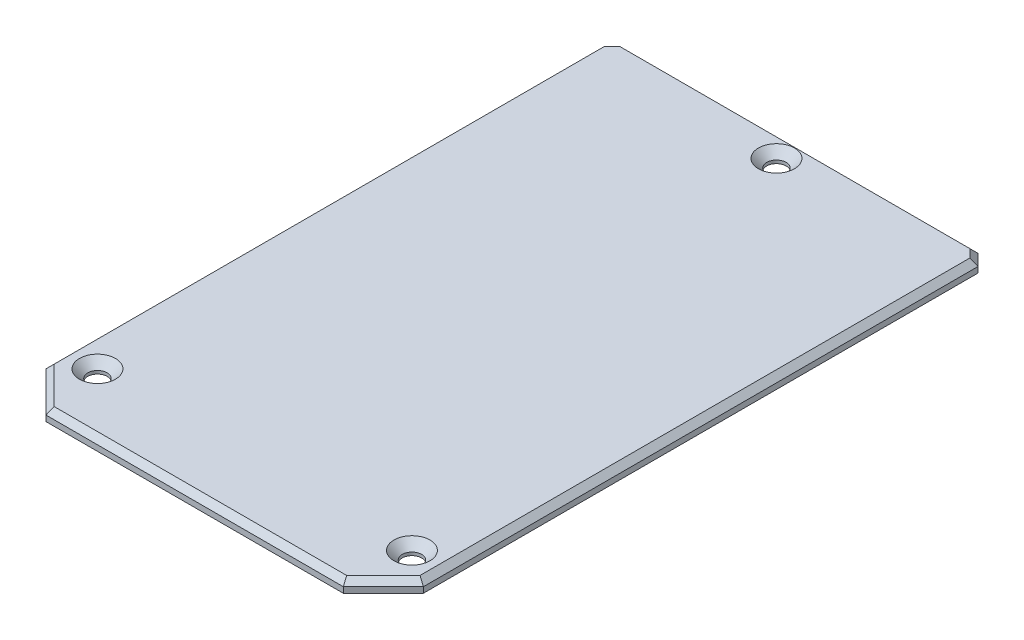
ISO-10303-21;
HEADER;
FILE_DESCRIPTION(('STEP AP214'),'2;1');
FILE_NAME('part.step','',(''),(''),'','','');
FILE_SCHEMA(('AUTOMOTIVE_DESIGN { 1 0 10303 214 1 1 1 1 }'));
ENDSEC;
DATA;
#1=APPLICATION_CONTEXT('core data for automotive mechanical design processes');
#2=APPLICATION_PROTOCOL_DEFINITION('international standard','automotive_design',2000,#1);
#3=PRODUCT_CONTEXT('',#1,'mechanical');
#4=PRODUCT('Part','Part','',(#3));
#5=PRODUCT_RELATED_PRODUCT_CATEGORY('part','',(#4));
#6=PRODUCT_DEFINITION_FORMATION('','',#4);
#7=PRODUCT_DEFINITION_CONTEXT('part definition',#1,'design');
#8=PRODUCT_DEFINITION('design','',#6,#7);
#9=PRODUCT_DEFINITION_SHAPE('','',#8);
#10=(LENGTH_UNIT() NAMED_UNIT(*) SI_UNIT(.MILLI.,.METRE.));
#11=(NAMED_UNIT(*) PLANE_ANGLE_UNIT() SI_UNIT($,.RADIAN.));
#12=(NAMED_UNIT(*) SI_UNIT($,.STERADIAN.) SOLID_ANGLE_UNIT());
#13=UNCERTAINTY_MEASURE_WITH_UNIT(LENGTH_MEASURE(1.E-05),#10,'distance_accuracy_value','');
#14=(GEOMETRIC_REPRESENTATION_CONTEXT(3) GLOBAL_UNCERTAINTY_ASSIGNED_CONTEXT((#13)) GLOBAL_UNIT_ASSIGNED_CONTEXT((#10,
#11,#12)) REPRESENTATION_CONTEXT('',''));
#15=CARTESIAN_POINT('',(0.,0.,0.));
#16=DIRECTION('',(0.,0.,1.));
#17=DIRECTION('',(1.,0.,0.));
#18=AXIS2_PLACEMENT_3D('',#15,#16,#17);
#19=CARTESIAN_POINT('',(32.9999999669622,2.,45.9999999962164));
#20=DIRECTION('',(-1.,0.,0.));
#21=DIRECTION('',(0.,0.,1.));
#22=AXIS2_PLACEMENT_3D('',#19,#20,#21);
#23=PLANE('',#22);
#24=DIRECTION('',(0.,1.,0.));
#25=VECTOR('',#24,1.);
#26=CARTESIAN_POINT('',(32.9999999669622,2.,-50.9999999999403));
#27=LINE('',#26,#25);
#28=CARTESIAN_POINT('',(32.9999999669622,0.,-50.9999999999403));
#29=VERTEX_POINT('',#28);
#30=CARTESIAN_POINT('',(32.9999999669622,0.999999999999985,-50.9999999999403));
#31=VERTEX_POINT('',#30);
#32=EDGE_CURVE('E167',#29,#31,#27,.T.);
#33=ORIENTED_EDGE('',*,*,#32,.T.);
#34=DIRECTION('',(0.,0.,1.));
#35=VECTOR('',#34,1.);
#36=CARTESIAN_POINT('',(32.9999999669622,0.999999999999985,45.9999999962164));
#37=LINE('',#36,#35);
#38=CARTESIAN_POINT('',(32.9999999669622,0.999999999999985,45.9999999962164));
#39=VERTEX_POINT('',#38);
#40=EDGE_CURVE('E193',#31,#39,#37,.T.);
#41=ORIENTED_EDGE('',*,*,#40,.T.);
#42=DIRECTION('',(0.,-1.,0.));
#43=VECTOR('',#42,1.);
#44=CARTESIAN_POINT('',(32.9999999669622,2.,45.9999999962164));
#45=LINE('',#44,#43);
#46=CARTESIAN_POINT('',(32.9999999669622,0.,45.9999999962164));
#47=VERTEX_POINT('',#46);
#48=EDGE_CURVE('E155',#39,#47,#45,.T.);
#49=ORIENTED_EDGE('',*,*,#48,.T.);
#50=DIRECTION('',(0.,0.,-1.));
#51=VECTOR('',#50,1.);
#52=CARTESIAN_POINT('',(32.9999999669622,0.,45.9999999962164));
#53=LINE('',#52,#51);
#54=EDGE_CURVE('E256',#47,#29,#53,.T.);
#55=ORIENTED_EDGE('',*,*,#54,.T.);
#56=EDGE_LOOP('',(#33,#41,#49,#55));
#57=FACE_BOUND('',#56,.T.);
#58=ADVANCED_FACE('F33',(#57),#23,.F.);
#59=CARTESIAN_POINT('',(-32.9999999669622,2.,-52.9999999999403));
#60=DIRECTION('',(0.,0.,1.));
#61=DIRECTION('',(1.,0.,0.));
#62=AXIS2_PLACEMENT_3D('',#59,#60,#61);
#63=PLANE('',#62);
#64=DIRECTION('',(0.,1.,0.));
#65=VECTOR('',#64,1.);
#66=CARTESIAN_POINT('',(-30.9999999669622,2.,-52.9999999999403));
#67=LINE('',#66,#65);
#68=CARTESIAN_POINT('',(-30.9999999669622,0.,-52.9999999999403));
#69=VERTEX_POINT('',#68);
#70=CARTESIAN_POINT('',(-30.9999999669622,0.999999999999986,-52.9999999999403));
#71=VERTEX_POINT('',#70);
#72=EDGE_CURVE('E132',#69,#71,#67,.T.);
#73=ORIENTED_EDGE('',*,*,#72,.T.);
#74=DIRECTION('',(1.,0.,0.));
#75=VECTOR('',#74,1.);
#76=CARTESIAN_POINT('',(-32.9999999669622,0.999999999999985,-52.9999999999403));
#77=LINE('',#76,#75);
#78=CARTESIAN_POINT('',(30.9999999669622,0.999999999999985,-52.9999999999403));
#79=VERTEX_POINT('',#78);
#80=EDGE_CURVE('E197',#71,#79,#77,.T.);
#81=ORIENTED_EDGE('',*,*,#80,.T.);
#82=DIRECTION('',(0.,-1.,0.));
#83=VECTOR('',#82,1.);
#84=CARTESIAN_POINT('',(30.9999999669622,2.,-52.9999999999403));
#85=LINE('',#84,#83);
#86=CARTESIAN_POINT('',(30.9999999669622,0.,-52.9999999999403));
#87=VERTEX_POINT('',#86);
#88=EDGE_CURVE('E161',#79,#87,#85,.T.);
#89=ORIENTED_EDGE('',*,*,#88,.T.);
#90=DIRECTION('',(-1.,0.,0.));
#91=VECTOR('',#90,1.);
#92=CARTESIAN_POINT('',(-32.9999999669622,0.,-52.9999999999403));
#93=LINE('',#92,#91);
#94=EDGE_CURVE('E141',#87,#69,#93,.T.);
#95=ORIENTED_EDGE('',*,*,#94,.T.);
#96=EDGE_LOOP('',(#73,#81,#89,#95));
#97=FACE_BOUND('',#96,.T.);
#98=ADVANCED_FACE('F260',(#97),#63,.F.);
#99=CARTESIAN_POINT('',(-32.9999999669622,2.,45.9999999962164));
#100=DIRECTION('',(1.,0.,0.));
#101=DIRECTION('',(0.,0.,-1.));
#102=AXIS2_PLACEMENT_3D('',#99,#100,#101);
#103=PLANE('',#102);
#104=DIRECTION('',(0.,-1.,0.));
#105=VECTOR('',#104,1.);
#106=CARTESIAN_POINT('',(-32.9999999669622,2.,45.9999999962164));
#107=LINE('',#106,#105);
#108=CARTESIAN_POINT('',(-32.9999999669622,0.999999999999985,45.9999999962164));
#109=VERTEX_POINT('',#108);
#110=CARTESIAN_POINT('',(-32.9999999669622,0.,45.9999999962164));
#111=VERTEX_POINT('',#110);
#112=EDGE_CURVE('E123',#109,#111,#107,.T.);
#113=ORIENTED_EDGE('',*,*,#112,.F.);
#114=DIRECTION('',(0.,0.,-1.));
#115=VECTOR('',#114,1.);
#116=CARTESIAN_POINT('',(-32.9999999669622,0.999999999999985,45.9999999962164));
#117=LINE('',#116,#115);
#118=CARTESIAN_POINT('',(-32.9999999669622,0.999999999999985,-50.9999999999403));
#119=VERTEX_POINT('',#118);
#120=EDGE_CURVE('E11',#109,#119,#117,.T.);
#121=ORIENTED_EDGE('',*,*,#120,.T.);
#122=DIRECTION('',(0.,-1.,0.));
#123=VECTOR('',#122,1.);
#124=CARTESIAN_POINT('',(-32.9999999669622,2.,-50.9999999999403));
#125=LINE('',#124,#123);
#126=CARTESIAN_POINT('',(-32.9999999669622,0.,-50.9999999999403));
#127=VERTEX_POINT('',#126);
#128=EDGE_CURVE('E138',#119,#127,#125,.T.);
#129=ORIENTED_EDGE('',*,*,#128,.T.);
#130=DIRECTION('',(0.,0.,1.));
#131=VECTOR('',#130,1.);
#132=CARTESIAN_POINT('',(-32.9999999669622,0.,45.9999999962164));
#133=LINE('',#132,#131);
#134=EDGE_CURVE('E136',#127,#111,#133,.T.);
#135=ORIENTED_EDGE('',*,*,#134,.T.);
#136=EDGE_LOOP('',(#113,#121,#129,#135));
#137=FACE_BOUND('',#136,.T.);
#138=ADVANCED_FACE('F137',(#137),#103,.F.);
#139=CARTESIAN_POINT('',(-32.9999999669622,2.,45.9999999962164));
#140=DIRECTION('',(0.70710678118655,0.,-0.707106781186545));
#141=DIRECTION('',(-0.707106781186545,0.,-0.70710678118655));
#142=AXIS2_PLACEMENT_3D('',#139,#140,#141);
#143=PLANE('',#142);
#144=DIRECTION('',(0.,-1.,0.));
#145=VECTOR('',#144,1.);
#146=CARTESIAN_POINT('',(-25.99999999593,2.,52.9999999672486));
#147=LINE('',#146,#145);
#148=CARTESIAN_POINT('',(-25.99999999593,0.999999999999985,52.9999999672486));
#149=VERTEX_POINT('',#148);
#150=CARTESIAN_POINT('',(-25.99999999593,0.,52.9999999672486));
#151=VERTEX_POINT('',#150);
#152=EDGE_CURVE('E133',#149,#151,#147,.T.);
#153=ORIENTED_EDGE('',*,*,#152,.F.);
#154=DIRECTION('',(-0.707106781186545,0.,-0.70710678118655));
#155=VECTOR('',#154,1.);
#156=CARTESIAN_POINT('',(-32.9999999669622,0.999999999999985,45.9999999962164));
#157=LINE('',#156,#155);
#158=EDGE_CURVE('E131',#149,#109,#157,.T.);
#159=ORIENTED_EDGE('',*,*,#158,.T.);
#160=ORIENTED_EDGE('',*,*,#112,.T.);
#161=DIRECTION('',(0.707106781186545,0.,0.70710678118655));
#162=VECTOR('',#161,1.);
#163=CARTESIAN_POINT('',(-32.9999999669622,0.,45.9999999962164));
#164=LINE('',#163,#162);
#165=EDGE_CURVE('E128',#111,#151,#164,.T.);
#166=ORIENTED_EDGE('',*,*,#165,.T.);
#167=EDGE_LOOP('',(#153,#159,#160,#166));
#168=FACE_BOUND('',#167,.T.);
#169=ADVANCED_FACE('F126',(#168),#143,.F.);
#170=CARTESIAN_POINT('',(25.99999999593,2.,52.9999999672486));
#171=DIRECTION('',(0.,0.,-1.));
#172=DIRECTION('',(-1.,0.,0.));
#173=AXIS2_PLACEMENT_3D('',#170,#171,#172);
#174=PLANE('',#173);
#175=DIRECTION('',(0.,-1.,0.));
#176=VECTOR('',#175,1.);
#177=CARTESIAN_POINT('',(25.99999999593,2.,52.9999999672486));
#178=LINE('',#177,#176);
#179=CARTESIAN_POINT('',(25.99999999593,0.999999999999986,52.9999999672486));
#180=VERTEX_POINT('',#179);
#181=CARTESIAN_POINT('',(25.99999999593,0.,52.9999999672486));
#182=VERTEX_POINT('',#181);
#183=EDGE_CURVE('E157',#180,#182,#178,.T.);
#184=ORIENTED_EDGE('',*,*,#183,.F.);
#185=DIRECTION('',(-1.,0.,0.));
#186=VECTOR('',#185,1.);
#187=CARTESIAN_POINT('',(25.99999999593,0.999999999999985,52.9999999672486));
#188=LINE('',#187,#186);
#189=EDGE_CURVE('E189',#180,#149,#188,.T.);
#190=ORIENTED_EDGE('',*,*,#189,.T.);
#191=ORIENTED_EDGE('',*,*,#152,.T.);
#192=DIRECTION('',(1.,0.,0.));
#193=VECTOR('',#192,1.);
#194=CARTESIAN_POINT('',(25.99999999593,0.,52.9999999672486));
#195=LINE('',#194,#193);
#196=EDGE_CURVE('E147',#151,#182,#195,.T.);
#197=ORIENTED_EDGE('',*,*,#196,.T.);
#198=EDGE_LOOP('',(#184,#190,#191,#197));
#199=FACE_BOUND('',#198,.T.);
#200=ADVANCED_FACE('F295',(#199),#174,.F.);
#201=CARTESIAN_POINT('',(32.9999999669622,2.,45.9999999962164));
#202=DIRECTION('',(-0.707106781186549,0.,-0.707106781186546));
#203=DIRECTION('',(-0.707106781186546,0.,0.707106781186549));
#204=AXIS2_PLACEMENT_3D('',#201,#202,#203);
#205=PLANE('',#204);
#206=ORIENTED_EDGE('',*,*,#48,.F.);
#207=DIRECTION('',(-0.707106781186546,0.,0.707106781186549));
#208=VECTOR('',#207,1.);
#209=CARTESIAN_POINT('',(32.9999999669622,0.999999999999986,45.9999999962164));
#210=LINE('',#209,#208);
#211=EDGE_CURVE('E191',#39,#180,#210,.T.);
#212=ORIENTED_EDGE('',*,*,#211,.T.);
#213=ORIENTED_EDGE('',*,*,#183,.T.);
#214=DIRECTION('',(0.707106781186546,0.,-0.707106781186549));
#215=VECTOR('',#214,1.);
#216=CARTESIAN_POINT('',(32.9999999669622,0.,45.9999999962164));
#217=LINE('',#216,#215);
#218=EDGE_CURVE('E149',#182,#47,#217,.T.);
#219=ORIENTED_EDGE('',*,*,#218,.T.);
#220=EDGE_LOOP('',(#206,#212,#213,#219));
#221=FACE_BOUND('',#220,.T.);
#222=ADVANCED_FACE('F290',(#221),#205,.F.);
#223=CARTESIAN_POINT('',(0.,2.,0.));
#224=DIRECTION('',(0.,-1.,0.));
#225=DIRECTION('',(0.,0.,-1.));
#226=AXIS2_PLACEMENT_3D('',#223,#224,#225);
#227=PLANE('',#226);
#228=DIRECTION('',(0.,0.,1.));
#229=VECTOR('',#228,1.);
#230=CARTESIAN_POINT('',(-31.9999999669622,2.,0.));
#231=LINE('',#230,#229);
#232=CARTESIAN_POINT('',(-31.9999999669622,2.,-50.5857864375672));
#233=VERTEX_POINT('',#232);
#234=CARTESIAN_POINT('',(-31.9999999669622,2.,45.5857864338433));
#235=VERTEX_POINT('',#234);
#236=EDGE_CURVE('E171',#233,#235,#231,.T.);
#237=ORIENTED_EDGE('',*,*,#236,.T.);
#238=DIRECTION('',(0.707106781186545,0.,0.70710678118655));
#239=VECTOR('',#238,1.);
#240=CARTESIAN_POINT('',(-38.7928932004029,2.,38.7928932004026));
#241=LINE('',#240,#239);
#242=CARTESIAN_POINT('',(-25.5857864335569,2.,51.9999999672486));
#243=VERTEX_POINT('',#242);
#244=EDGE_CURVE('E185',#235,#243,#241,.T.);
#245=ORIENTED_EDGE('',*,*,#244,.T.);
#246=DIRECTION('',(1.,0.,0.));
#247=VECTOR('',#246,1.);
#248=CARTESIAN_POINT('',(0.,2.,51.9999999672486));
#249=LINE('',#248,#247);
#250=CARTESIAN_POINT('',(25.5857864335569,2.,51.9999999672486));
#251=VERTEX_POINT('',#250);
#252=EDGE_CURVE('E183',#243,#251,#249,.T.);
#253=ORIENTED_EDGE('',*,*,#252,.T.);
#254=DIRECTION('',(0.707106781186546,0.,-0.707106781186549));
#255=VECTOR('',#254,1.);
#256=CARTESIAN_POINT('',(38.7928932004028,2.,38.7928932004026));
#257=LINE('',#256,#255);
#258=CARTESIAN_POINT('',(31.9999999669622,2.,45.5857864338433));
#259=VERTEX_POINT('',#258);
#260=EDGE_CURVE('E181',#251,#259,#257,.T.);
#261=ORIENTED_EDGE('',*,*,#260,.T.);
#262=DIRECTION('',(0.,0.,-1.));
#263=VECTOR('',#262,1.);
#264=CARTESIAN_POINT('',(31.9999999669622,2.,0.));
#265=LINE('',#264,#263);
#266=CARTESIAN_POINT('',(31.9999999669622,2.,-50.5857864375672));
#267=VERTEX_POINT('',#266);
#268=EDGE_CURVE('E179',#259,#267,#265,.T.);
#269=ORIENTED_EDGE('',*,*,#268,.T.);
#270=DIRECTION('',(-0.707106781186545,0.,-0.70710678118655));
#271=VECTOR('',#270,1.);
#272=CARTESIAN_POINT('',(30.2928931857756,2.,-52.2928932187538));
#273=LINE('',#272,#271);
#274=CARTESIAN_POINT('',(30.5857864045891,2.,-51.9999999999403));
#275=VERTEX_POINT('',#274);
#276=EDGE_CURVE('E177',#267,#275,#273,.T.);
#277=ORIENTED_EDGE('',*,*,#276,.T.);
#278=DIRECTION('',(-1.,0.,0.));
#279=VECTOR('',#278,1.);
#280=CARTESIAN_POINT('',(0.,2.,-51.9999999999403));
#281=LINE('',#280,#279);
#282=CARTESIAN_POINT('',(-30.5857864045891,2.,-51.9999999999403));
#283=VERTEX_POINT('',#282);
#284=EDGE_CURVE('E175',#275,#283,#281,.T.);
#285=ORIENTED_EDGE('',*,*,#284,.T.);
#286=DIRECTION('',(-0.707106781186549,0.,0.707106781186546));
#287=VECTOR('',#286,1.);
#288=CARTESIAN_POINT('',(-32.2928931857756,2.,-50.2928932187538));
#289=LINE('',#288,#287);
#290=EDGE_CURVE('E173',#283,#233,#289,.T.);
#291=ORIENTED_EDGE('',*,*,#290,.T.);
#292=EDGE_LOOP('',(#237,#245,#253,#261,#269,#277,#285,#291));
#293=FACE_BOUND('',#292,.T.);
#294=CARTESIAN_POINT('',(-27.4999999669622,2.,42.5000000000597));
#295=DIRECTION('',(0.,1.,0.));
#296=DIRECTION('',(0.,0.,1.));
#297=AXIS2_PLACEMENT_3D('',#294,#295,#296);
#298=CIRCLE('',#297,3.15);
#299=CARTESIAN_POINT('',(-27.4999999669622,2.,45.6500000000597));
#300=VERTEX_POINT('',#299);
#301=EDGE_CURVE('E222',#300,#300,#298,.T.);
#302=ORIENTED_EDGE('',*,*,#301,.F.);
#303=EDGE_LOOP('',(#302));
#304=FACE_BOUND('',#303,.T.);
#305=CARTESIAN_POINT('',(27.4999999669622,2.,42.5000000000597));
#306=DIRECTION('',(0.,1.,0.));
#307=DIRECTION('',(0.,0.,1.));
#308=AXIS2_PLACEMENT_3D('',#305,#306,#307);
#309=CIRCLE('',#308,3.15);
#310=CARTESIAN_POINT('',(27.4999999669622,2.,45.6500000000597));
#311=VERTEX_POINT('',#310);
#312=EDGE_CURVE('E238',#311,#311,#309,.T.);
#313=ORIENTED_EDGE('',*,*,#312,.F.);
#314=EDGE_LOOP('',(#313));
#315=FACE_BOUND('',#314,.T.);
#316=CARTESIAN_POINT('',(3.30378363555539E-08,2.,-48.7499999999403));
#317=DIRECTION('',(0.,1.,0.));
#318=DIRECTION('',(0.,0.,1.));
#319=AXIS2_PLACEMENT_3D('',#316,#317,#318);
#320=CIRCLE('',#319,3.15);
#321=CARTESIAN_POINT('',(3.30378363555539E-08,2.,-45.5999999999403));
#322=VERTEX_POINT('',#321);
#323=EDGE_CURVE('E247',#322,#322,#320,.T.);
#324=ORIENTED_EDGE('',*,*,#323,.F.);
#325=EDGE_LOOP('',(#324));
#326=FACE_BOUND('',#325,.T.);
#327=ADVANCED_FACE('F275',(#293,#304,#315,#326),#227,.F.);
#328=CARTESIAN_POINT('',(0.,0.,0.));
#329=DIRECTION('',(0.,-1.,0.));
#330=DIRECTION('',(0.,0.,-1.));
#331=AXIS2_PLACEMENT_3D('',#328,#329,#330);
#332=PLANE('',#331);
#333=CARTESIAN_POINT('',(-27.4999999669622,0.,42.5000000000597));
#334=DIRECTION('',(0.,1.,0.));
#335=DIRECTION('',(0.,0.,1.));
#336=AXIS2_PLACEMENT_3D('',#333,#334,#335);
#337=CIRCLE('',#336,1.7);
#338=CARTESIAN_POINT('',(-27.4999999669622,0.,44.2000000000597));
#339=VERTEX_POINT('',#338);
#340=EDGE_CURVE('E233',#339,#339,#337,.T.);
#341=ORIENTED_EDGE('',*,*,#340,.T.);
#342=EDGE_LOOP('',(#341));
#343=FACE_BOUND('',#342,.T.);
#344=CARTESIAN_POINT('',(27.4999999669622,0.,42.5000000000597));
#345=DIRECTION('',(0.,1.,0.));
#346=DIRECTION('',(0.,0.,1.));
#347=AXIS2_PLACEMENT_3D('',#344,#345,#346);
#348=CIRCLE('',#347,1.7);
#349=CARTESIAN_POINT('',(27.4999999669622,0.,44.2000000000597));
#350=VERTEX_POINT('',#349);
#351=EDGE_CURVE('E244',#350,#350,#348,.T.);
#352=ORIENTED_EDGE('',*,*,#351,.T.);
#353=EDGE_LOOP('',(#352));
#354=FACE_BOUND('',#353,.T.);
#355=CARTESIAN_POINT('',(3.30378363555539E-08,0.,-48.7499999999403));
#356=DIRECTION('',(0.,1.,0.));
#357=DIRECTION('',(0.,0.,1.));
#358=AXIS2_PLACEMENT_3D('',#355,#356,#357);
#359=CIRCLE('',#358,1.7);
#360=CARTESIAN_POINT('',(3.30378363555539E-08,0.,-47.0499999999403));
#361=VERTEX_POINT('',#360);
#362=EDGE_CURVE('E253',#361,#361,#359,.T.);
#363=ORIENTED_EDGE('',*,*,#362,.T.);
#364=EDGE_LOOP('',(#363));
#365=FACE_BOUND('',#364,.T.);
#366=ORIENTED_EDGE('',*,*,#94,.F.);
#367=DIRECTION('',(-0.707106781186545,0.,-0.70710678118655));
#368=VECTOR('',#367,1.);
#369=CARTESIAN_POINT('',(41.9999999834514,0.,-41.9999999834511));
#370=LINE('',#369,#368);
#371=EDGE_CURVE('E165',#87,#29,#370,.F.);
#372=ORIENTED_EDGE('',*,*,#371,.T.);
#373=ORIENTED_EDGE('',*,*,#54,.F.);
#374=ORIENTED_EDGE('',*,*,#218,.F.);
#375=ORIENTED_EDGE('',*,*,#196,.F.);
#376=ORIENTED_EDGE('',*,*,#165,.F.);
#377=ORIENTED_EDGE('',*,*,#134,.F.);
#378=DIRECTION('',(-0.707106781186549,0.,0.707106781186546));
#379=VECTOR('',#378,1.);
#380=CARTESIAN_POINT('',(-41.9999999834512,0.,-41.9999999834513));
#381=LINE('',#380,#379);
#382=EDGE_CURVE('E163',#127,#69,#381,.F.);
#383=ORIENTED_EDGE('',*,*,#382,.T.);
#384=EDGE_LOOP('',(#366,#372,#373,#374,#375,#376,#377,#383));
#385=FACE_BOUND('',#384,.T.);
#386=ADVANCED_FACE('F144',(#343,#354,#365,#385),#332,.T.);
#387=CARTESIAN_POINT('',(30.9999999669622,2.,-52.9999999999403));
#388=DIRECTION('',(-0.70710678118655,0.,0.707106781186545));
#389=DIRECTION('',(0.,-1.,0.));
#390=AXIS2_PLACEMENT_3D('',#387,#388,#389);
#391=PLANE('',#390);
#392=ORIENTED_EDGE('',*,*,#88,.F.);
#393=DIRECTION('',(-0.707106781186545,0.,-0.70710678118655));
#394=VECTOR('',#393,1.);
#395=CARTESIAN_POINT('',(32.9999999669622,0.999999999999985,-50.9999999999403));
#396=LINE('',#395,#394);
#397=EDGE_CURVE('E195',#79,#31,#396,.F.);
#398=ORIENTED_EDGE('',*,*,#397,.T.);
#399=ORIENTED_EDGE('',*,*,#32,.F.);
#400=ORIENTED_EDGE('',*,*,#371,.F.);
#401=EDGE_LOOP('',(#392,#398,#399,#400));
#402=FACE_BOUND('',#401,.T.);
#403=ADVANCED_FACE('F281',(#402),#391,.F.);
#404=CARTESIAN_POINT('',(-32.9999999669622,2.,-50.9999999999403));
#405=DIRECTION('',(0.707106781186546,0.,0.707106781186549));
#406=DIRECTION('',(0.,-1.,0.));
#407=AXIS2_PLACEMENT_3D('',#404,#405,#406);
#408=PLANE('',#407);
#409=ORIENTED_EDGE('',*,*,#128,.F.);
#410=DIRECTION('',(-0.707106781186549,0.,0.707106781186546));
#411=VECTOR('',#410,1.);
#412=CARTESIAN_POINT('',(-30.9999999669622,0.999999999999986,-52.9999999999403));
#413=LINE('',#412,#411);
#414=EDGE_CURVE('E42',#119,#71,#413,.F.);
#415=ORIENTED_EDGE('',*,*,#414,.T.);
#416=ORIENTED_EDGE('',*,*,#72,.F.);
#417=ORIENTED_EDGE('',*,*,#382,.F.);
#418=EDGE_LOOP('',(#409,#415,#416,#417));
#419=FACE_BOUND('',#418,.T.);
#420=ADVANCED_FACE('F263',(#419),#408,.F.);
#421=CARTESIAN_POINT('',(3.30378363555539E-08,2.,-48.7499999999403));
#422=DIRECTION('',(0.,1.,0.));
#423=DIRECTION('',(0.,0.,1.));
#424=AXIS2_PLACEMENT_3D('',#421,#422,#423);
#425=CYLINDRICAL_SURFACE('',#424,1.7);
#426=ORIENTED_EDGE('',*,*,#362,.F.);
#427=EDGE_LOOP('',(#426));
#428=FACE_BOUND('',#427,.T.);
#429=CARTESIAN_POINT('',(3.30378363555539E-08,0.550000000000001,-48.7499999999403));
#430=DIRECTION('',(0.,1.,0.));
#431=DIRECTION('',(0.,0.,1.));
#432=AXIS2_PLACEMENT_3D('',#429,#430,#431);
#433=CIRCLE('',#432,1.7);
#434=CARTESIAN_POINT('',(3.30378363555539E-08,0.550000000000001,-47.0499999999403));
#435=VERTEX_POINT('',#434);
#436=EDGE_CURVE('E250',#435,#435,#433,.T.);
#437=ORIENTED_EDGE('',*,*,#436,.T.);
#438=EDGE_LOOP('',(#437));
#439=FACE_BOUND('',#438,.T.);
#440=ADVANCED_FACE('F326',(#428,#439),#425,.F.);
#441=CARTESIAN_POINT('',(3.30378363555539E-08,2.,-48.7499999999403));
#442=DIRECTION('',(0.,1.,0.));
#443=DIRECTION('',(0.,0.,1.));
#444=AXIS2_PLACEMENT_3D('',#441,#442,#443);
#445=CONICAL_SURFACE('',#444,3.15,0.785398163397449);
#446=ORIENTED_EDGE('',*,*,#436,.F.);
#447=EDGE_LOOP('',(#446));
#448=FACE_BOUND('',#447,.T.);
#449=ORIENTED_EDGE('',*,*,#323,.T.);
#450=EDGE_LOOP('',(#449));
#451=FACE_BOUND('',#450,.T.);
#452=ADVANCED_FACE('F411',(#448,#451),#445,.F.);
#453=CARTESIAN_POINT('',(27.4999999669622,2.,42.5000000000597));
#454=DIRECTION('',(0.,1.,0.));
#455=DIRECTION('',(0.,0.,1.));
#456=AXIS2_PLACEMENT_3D('',#453,#454,#455);
#457=CYLINDRICAL_SURFACE('',#456,1.69999999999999);
#458=ORIENTED_EDGE('',*,*,#351,.F.);
#459=EDGE_LOOP('',(#458));
#460=FACE_BOUND('',#459,.T.);
#461=CARTESIAN_POINT('',(27.4999999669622,0.549999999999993,42.5000000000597));
#462=DIRECTION('',(0.,1.,0.));
#463=DIRECTION('',(0.,0.,1.));
#464=AXIS2_PLACEMENT_3D('',#461,#462,#463);
#465=CIRCLE('',#464,1.69999999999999);
#466=CARTESIAN_POINT('',(27.4999999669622,0.549999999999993,44.2000000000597));
#467=VERTEX_POINT('',#466);
#468=EDGE_CURVE('E241',#467,#467,#465,.T.);
#469=ORIENTED_EDGE('',*,*,#468,.T.);
#470=EDGE_LOOP('',(#469));
#471=FACE_BOUND('',#470,.T.);
#472=ADVANCED_FACE('F402',(#460,#471),#457,.F.);
#473=CARTESIAN_POINT('',(27.4999999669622,2.,42.5000000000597));
#474=DIRECTION('',(0.,1.,0.));
#475=DIRECTION('',(0.,0.,1.));
#476=AXIS2_PLACEMENT_3D('',#473,#474,#475);
#477=CONICAL_SURFACE('',#476,3.15,0.78539816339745);
#478=ORIENTED_EDGE('',*,*,#468,.F.);
#479=EDGE_LOOP('',(#478));
#480=FACE_BOUND('',#479,.T.);
#481=ORIENTED_EDGE('',*,*,#312,.T.);
#482=EDGE_LOOP('',(#481));
#483=FACE_BOUND('',#482,.T.);
#484=ADVANCED_FACE('F393',(#480,#483),#477,.F.);
#485=CARTESIAN_POINT('',(-27.4999999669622,2.,42.5000000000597));
#486=DIRECTION('',(0.,1.,0.));
#487=DIRECTION('',(0.,0.,1.));
#488=AXIS2_PLACEMENT_3D('',#485,#486,#487);
#489=CYLINDRICAL_SURFACE('',#488,1.69999999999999);
#490=ORIENTED_EDGE('',*,*,#340,.F.);
#491=EDGE_LOOP('',(#490));
#492=FACE_BOUND('',#491,.T.);
#493=CARTESIAN_POINT('',(-27.4999999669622,0.549999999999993,42.5000000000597));
#494=DIRECTION('',(0.,1.,0.));
#495=DIRECTION('',(0.,0.,1.));
#496=AXIS2_PLACEMENT_3D('',#493,#494,#495);
#497=CIRCLE('',#496,1.69999999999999);
#498=CARTESIAN_POINT('',(-27.4999999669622,0.549999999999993,44.2000000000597));
#499=VERTEX_POINT('',#498);
#500=EDGE_CURVE('E228',#499,#499,#497,.T.);
#501=ORIENTED_EDGE('',*,*,#500,.T.);
#502=EDGE_LOOP('',(#501));
#503=FACE_BOUND('',#502,.T.);
#504=ADVANCED_FACE('F384',(#492,#503),#489,.F.);
#505=CARTESIAN_POINT('',(-27.4999999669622,2.,42.5000000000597));
#506=DIRECTION('',(0.,1.,0.));
#507=DIRECTION('',(0.,0.,1.));
#508=AXIS2_PLACEMENT_3D('',#505,#506,#507);
#509=CONICAL_SURFACE('',#508,3.15,0.78539816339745);
#510=ORIENTED_EDGE('',*,*,#500,.F.);
#511=EDGE_LOOP('',(#510));
#512=FACE_BOUND('',#511,.T.);
#513=ORIENTED_EDGE('',*,*,#301,.T.);
#514=EDGE_LOOP('',(#513));
#515=FACE_BOUND('',#514,.T.);
#516=ADVANCED_FACE('F376',(#512,#515),#509,.F.);
#517=CARTESIAN_POINT('',(41.2928932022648,2.,-41.2928932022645));
#518=DIRECTION('',(-0.500000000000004,-0.707106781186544,0.5));
#519=DIRECTION('',(-0.707106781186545,0.,-0.70710678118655));
#520=AXIS2_PLACEMENT_3D('',#517,#518,#519);
#521=PLANE('',#520);
#522=DIRECTION('',(0.678598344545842,-0.678598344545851,-0.281084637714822));
#523=VECTOR('',#522,1.);
#524=CARTESIAN_POINT('',(34.5067778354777,-0.506777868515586,-51.6241278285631));
#525=LINE('',#524,#523);
#526=EDGE_CURVE('E215',#31,#267,#525,.F.);
#527=ORIENTED_EDGE('',*,*,#526,.F.);
#528=ORIENTED_EDGE('',*,*,#397,.F.);
#529=DIRECTION('',(0.281084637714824,-0.678598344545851,-0.678598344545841));
#530=VECTOR('',#529,1.);
#531=CARTESIAN_POINT('',(28.1692470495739,7.83404208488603,-46.1659579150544));
#532=LINE('',#531,#530);
#533=EDGE_CURVE('E37',#275,#79,#532,.T.);
#534=ORIENTED_EDGE('',*,*,#533,.F.);
#535=ORIENTED_EDGE('',*,*,#276,.F.);
#536=EDGE_LOOP('',(#527,#528,#534,#535));
#537=FACE_BOUND('',#536,.T.);
#538=ADVANCED_FACE('F35',(#537),#521,.F.);
#539=CARTESIAN_POINT('',(0.,2.,-51.9999999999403));
#540=DIRECTION('',(0.,-0.707106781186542,0.707106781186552));
#541=DIRECTION('',(-1.,0.,0.));
#542=AXIS2_PLACEMENT_3D('',#539,#540,#541);
#543=PLANE('',#542);
#544=ORIENTED_EDGE('',*,*,#533,.T.);
#545=ORIENTED_EDGE('',*,*,#80,.F.);
#546=DIRECTION('',(-0.281084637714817,-0.678598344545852,-0.678598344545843));
#547=VECTOR('',#546,1.);
#548=CARTESIAN_POINT('',(-29.3894278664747,4.88826500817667,-49.1117349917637));
#549=LINE('',#548,#547);
#550=EDGE_CURVE('E213',#283,#71,#549,.T.);
#551=ORIENTED_EDGE('',*,*,#550,.F.);
#552=ORIENTED_EDGE('',*,*,#284,.F.);
#553=EDGE_LOOP('',(#544,#545,#551,#552));
#554=FACE_BOUND('',#553,.T.);
#555=ADVANCED_FACE('F278',(#554),#543,.F.);
#556=CARTESIAN_POINT('',(31.9999999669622,2.,0.));
#557=DIRECTION('',(-0.707106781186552,-0.707106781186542,0.));
#558=DIRECTION('',(0.,0.,-1.));
#559=AXIS2_PLACEMENT_3D('',#556,#557,#558);
#560=PLANE('',#559);
#561=ORIENTED_EDGE('',*,*,#526,.T.);
#562=ORIENTED_EDGE('',*,*,#268,.F.);
#563=DIRECTION('',(0.678598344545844,-0.678598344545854,0.281084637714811));
#564=VECTOR('',#563,1.);
#565=CARTESIAN_POINT('',(23.3048043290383,10.6951956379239,41.984118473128));
#566=LINE('',#565,#564);
#567=EDGE_CURVE('E210',#39,#259,#566,.F.);
#568=ORIENTED_EDGE('',*,*,#567,.F.);
#569=ORIENTED_EDGE('',*,*,#40,.F.);
#570=EDGE_LOOP('',(#561,#562,#568,#569));
#571=FACE_BOUND('',#570,.T.);
#572=ADVANCED_FACE('F285',(#571),#560,.F.);
#573=CARTESIAN_POINT('',(-41.2928932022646,2.,-41.2928932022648));
#574=DIRECTION('',(0.500000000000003,-0.707106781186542,0.500000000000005));
#575=DIRECTION('',(-0.707106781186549,0.,0.707106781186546));
#576=AXIS2_PLACEMENT_3D('',#573,#574,#575);
#577=PLANE('',#576);
#578=ORIENTED_EDGE('',*,*,#550,.T.);
#579=ORIENTED_EDGE('',*,*,#414,.F.);
#580=DIRECTION('',(-0.678598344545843,-0.678598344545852,-0.281084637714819));
#581=VECTOR('',#580,1.);
#582=CARTESIAN_POINT('',(-22.3510864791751,11.6489134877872,-46.5890756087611));
#583=LINE('',#582,#581);
#584=EDGE_CURVE('E207',#233,#119,#583,.T.);
#585=ORIENTED_EDGE('',*,*,#584,.F.);
#586=ORIENTED_EDGE('',*,*,#290,.F.);
#587=EDGE_LOOP('',(#578,#579,#585,#586));
#588=FACE_BOUND('',#587,.T.);
#589=ADVANCED_FACE('F266',(#588),#577,.F.);
#590=CARTESIAN_POINT('',(38.7928932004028,2.,38.7928932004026));
#591=DIRECTION('',(-0.500000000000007,-0.70710678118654,-0.500000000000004));
#592=DIRECTION('',(0.707106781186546,0.,-0.707106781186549));
#593=AXIS2_PLACEMENT_3D('',#590,#591,#592);
#594=PLANE('',#593);
#595=ORIENTED_EDGE('',*,*,#567,.T.);
#596=ORIENTED_EDGE('',*,*,#260,.F.);
#597=DIRECTION('',(0.281084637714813,-0.678598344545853,0.678598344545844));
#598=VECTOR('',#597,1.);
#599=CARTESIAN_POINT('',(24.110090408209,5.56264535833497,48.4373546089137));
#600=LINE('',#599,#598);
#601=EDGE_CURVE('E204',#180,#251,#600,.F.);
#602=ORIENTED_EDGE('',*,*,#601,.F.);
#603=ORIENTED_EDGE('',*,*,#211,.F.);
#604=EDGE_LOOP('',(#595,#596,#602,#603));
#605=FACE_BOUND('',#604,.T.);
#606=ADVANCED_FACE('F305',(#605),#594,.F.);
#607=CARTESIAN_POINT('',(-31.9999999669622,2.,0.));
#608=DIRECTION('',(0.707106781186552,-0.707106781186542,0.));
#609=DIRECTION('',(0.,0.,1.));
#610=AXIS2_PLACEMENT_3D('',#607,#608,#609);
#611=PLANE('',#610);
#612=ORIENTED_EDGE('',*,*,#584,.T.);
#613=ORIENTED_EDGE('',*,*,#120,.F.);
#614=DIRECTION('',(0.678598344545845,0.678598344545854,-0.281084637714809));
#615=VECTOR('',#614,1.);
#616=CARTESIAN_POINT('',(-23.3048043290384,10.6951956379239,41.9841184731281));
#617=LINE('',#616,#615);
#618=EDGE_CURVE('E202',#235,#109,#617,.F.);
#619=ORIENTED_EDGE('',*,*,#618,.F.);
#620=ORIENTED_EDGE('',*,*,#236,.F.);
#621=EDGE_LOOP('',(#612,#613,#619,#620));
#622=FACE_BOUND('',#621,.T.);
#623=ADVANCED_FACE('F271',(#622),#611,.F.);
#624=CARTESIAN_POINT('',(0.,2.,51.9999999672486));
#625=DIRECTION('',(0.,-0.707106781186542,-0.707106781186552));
#626=DIRECTION('',(1.,0.,0.));
#627=AXIS2_PLACEMENT_3D('',#624,#625,#626);
#628=PLANE('',#627);
#629=ORIENTED_EDGE('',*,*,#601,.T.);
#630=ORIENTED_EDGE('',*,*,#252,.F.);
#631=DIRECTION('',(-0.281084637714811,-0.678598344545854,0.678598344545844));
#632=VECTOR('',#631,1.);
#633=CARTESIAN_POINT('',(-23.5642899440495,6.88032424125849,47.1196757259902));
#634=LINE('',#633,#632);
#635=EDGE_CURVE('E200',#149,#243,#634,.F.);
#636=ORIENTED_EDGE('',*,*,#635,.F.);
#637=ORIENTED_EDGE('',*,*,#189,.F.);
#638=EDGE_LOOP('',(#629,#630,#636,#637));
#639=FACE_BOUND('',#638,.T.);
#640=ADVANCED_FACE('F302',(#639),#628,.F.);
#641=CARTESIAN_POINT('',(-38.7928932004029,2.,38.7928932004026));
#642=DIRECTION('',(0.500000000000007,-0.707106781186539,-0.500000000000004));
#643=DIRECTION('',(0.707106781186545,0.,0.70710678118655));
#644=AXIS2_PLACEMENT_3D('',#641,#642,#643);
#645=PLANE('',#644);
#646=ORIENTED_EDGE('',*,*,#618,.T.);
#647=ORIENTED_EDGE('',*,*,#158,.F.);
#648=ORIENTED_EDGE('',*,*,#635,.T.);
#649=ORIENTED_EDGE('',*,*,#244,.F.);
#650=EDGE_LOOP('',(#646,#647,#648,#649));
#651=FACE_BOUND('',#650,.T.);
#652=ADVANCED_FACE('F299',(#651),#645,.F.);
#653=CLOSED_SHELL('',(#58,#98,#138,#169,#200,#222,#327,#386,#403,#420,#440,#452,#472,#484,#504,
#516,#538,#555,#572,#589,#606,#623,#640,#652));
#654=MANIFOLD_SOLID_BREP('B2',#653);
#655=ADVANCED_BREP_SHAPE_REPRESENTATION('',(#18,#654),#14);
#656=SHAPE_DEFINITION_REPRESENTATION(#9,#655);
ENDSEC;
END-ISO-10303-21;
